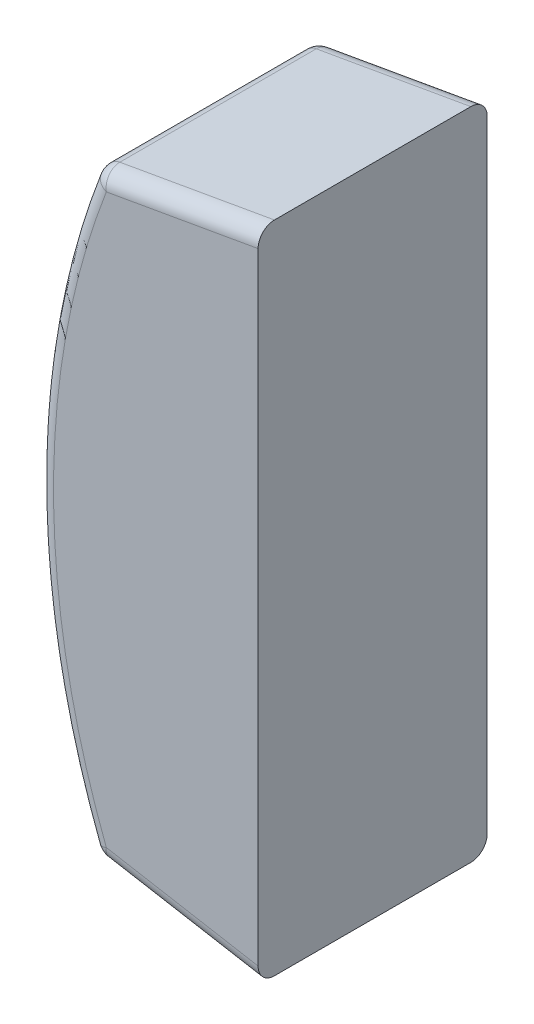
ISO-10303-21;
HEADER;
FILE_DESCRIPTION(('STEP AP214'),'2;1');
FILE_NAME('part.step','',(''),(''),'','','');
FILE_SCHEMA(('AUTOMOTIVE_DESIGN { 1 0 10303 214 1 1 1 1 }'));
ENDSEC;
DATA;
#1=APPLICATION_CONTEXT('core data for automotive mechanical design processes');
#2=APPLICATION_PROTOCOL_DEFINITION('international standard','automotive_design',2000,#1);
#3=PRODUCT_CONTEXT('',#1,'mechanical');
#4=PRODUCT('Part','Part','',(#3));
#5=PRODUCT_RELATED_PRODUCT_CATEGORY('part','',(#4));
#6=PRODUCT_DEFINITION_FORMATION('','',#4);
#7=PRODUCT_DEFINITION_CONTEXT('part definition',#1,'design');
#8=PRODUCT_DEFINITION('design','',#6,#7);
#9=PRODUCT_DEFINITION_SHAPE('','',#8);
#10=(LENGTH_UNIT() NAMED_UNIT(*) SI_UNIT(.MILLI.,.METRE.));
#11=(NAMED_UNIT(*) PLANE_ANGLE_UNIT() SI_UNIT($,.RADIAN.));
#12=(NAMED_UNIT(*) SI_UNIT($,.STERADIAN.) SOLID_ANGLE_UNIT());
#13=UNCERTAINTY_MEASURE_WITH_UNIT(LENGTH_MEASURE(1.E-05),#10,'distance_accuracy_value','');
#14=(GEOMETRIC_REPRESENTATION_CONTEXT(3) GLOBAL_UNCERTAINTY_ASSIGNED_CONTEXT((#13)) GLOBAL_UNIT_ASSIGNED_CONTEXT((#10,
#11,#12)) REPRESENTATION_CONTEXT('',''));
#15=CARTESIAN_POINT('',(0.,0.,0.));
#16=DIRECTION('',(0.,0.,1.));
#17=DIRECTION('',(1.,0.,0.));
#18=AXIS2_PLACEMENT_3D('',#15,#16,#17);
#19=CARTESIAN_POINT('',(0.,0.,28.));
#20=DIRECTION('',(0.173648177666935,0.984807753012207,0.));
#21=DIRECTION('',(-0.984807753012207,0.173648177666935,0.));
#22=AXIS2_PLACEMENT_3D('',#19,#20,#21);
#23=PLANE('',#22);
#24=DIRECTION('',(0.,0.,-1.));
#25=VECTOR('',#24,1.);
#26=CARTESIAN_POINT('',(-18.894708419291,3.3316468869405,28.));
#27=LINE('',#26,#25);
#28=CARTESIAN_POINT('',(-18.894708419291,3.3316468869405,26.));
#29=VERTEX_POINT('',#28);
#30=CARTESIAN_POINT('',(-18.894708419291,3.3316468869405,2.));
#31=VERTEX_POINT('',#30);
#32=EDGE_CURVE('E134',#29,#31,#27,.T.);
#33=ORIENTED_EDGE('',*,*,#32,.T.);
#34=DIRECTION('',(0.984807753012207,-0.173648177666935,0.));
#35=VECTOR('',#34,1.);
#36=CARTESIAN_POINT('',(0.,0.,2.));
#37=LINE('',#36,#35);
#38=CARTESIAN_POINT('',(0.,0.,2.));
#39=VERTEX_POINT('',#38);
#40=EDGE_CURVE('E133',#31,#39,#37,.T.);
#41=ORIENTED_EDGE('',*,*,#40,.T.);
#42=DIRECTION('',(0.,0.,-1.));
#43=VECTOR('',#42,1.);
#44=CARTESIAN_POINT('',(0.,0.,28.));
#45=LINE('',#44,#43);
#46=CARTESIAN_POINT('',(0.,0.,26.));
#47=VERTEX_POINT('',#46);
#48=EDGE_CURVE('E119',#47,#39,#45,.T.);
#49=ORIENTED_EDGE('',*,*,#48,.F.);
#50=DIRECTION('',(0.984807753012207,-0.173648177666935,0.));
#51=VECTOR('',#50,1.);
#52=CARTESIAN_POINT('',(-20.,3.52653961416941,26.));
#53=LINE('',#52,#51);
#54=EDGE_CURVE('E130',#47,#29,#53,.F.);
#55=ORIENTED_EDGE('',*,*,#54,.T.);
#56=EDGE_LOOP('',(#33,#41,#49,#55));
#57=FACE_BOUND('',#56,.T.);
#58=ADVANCED_FACE('F39',(#57),#23,.F.);
#59=CARTESIAN_POINT('',(0.,0.,28.));
#60=DIRECTION('',(-1.,0.,0.));
#61=DIRECTION('',(0.,0.,1.));
#62=AXIS2_PLACEMENT_3D('',#59,#60,#61);
#63=PLANE('',#62);
#64=ORIENTED_EDGE('',*,*,#48,.T.);
#65=CARTESIAN_POINT('',(0.,2.03085322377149,2.));
#66=DIRECTION('',(-1.,0.,0.));
#67=DIRECTION('',(0.,-1.,0.));
#68=AXIS2_PLACEMENT_3D('',#65,#66,#67);
#69=ELLIPSE('',#68,2.03085322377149,2.);
#70=CARTESIAN_POINT('',(0.,2.03085322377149,0.));
#71=VERTEX_POINT('',#70);
#72=EDGE_CURVE('E125',#39,#71,#69,.F.);
#73=ORIENTED_EDGE('',*,*,#72,.T.);
#74=DIRECTION('',(0.,1.,0.));
#75=VECTOR('',#74,1.);
#76=CARTESIAN_POINT('',(0.,0.,0.));
#77=LINE('',#76,#75);
#78=CARTESIAN_POINT('',(0.,77.9691467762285,0.));
#79=VERTEX_POINT('',#78);
#80=EDGE_CURVE('E204',#71,#79,#77,.T.);
#81=ORIENTED_EDGE('',*,*,#80,.T.);
#82=CARTESIAN_POINT('',(0.,77.9691467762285,2.));
#83=DIRECTION('',(-1.,0.,0.));
#84=DIRECTION('',(0.,-1.,0.));
#85=AXIS2_PLACEMENT_3D('',#82,#83,#84);
#86=ELLIPSE('',#85,2.03085322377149,2.);
#87=CARTESIAN_POINT('',(0.,80.,2.));
#88=VERTEX_POINT('',#87);
#89=EDGE_CURVE('E126',#79,#88,#86,.F.);
#90=ORIENTED_EDGE('',*,*,#89,.T.);
#91=DIRECTION('',(0.,0.,-1.));
#92=VECTOR('',#91,1.);
#93=CARTESIAN_POINT('',(0.,80.,28.));
#94=LINE('',#93,#92);
#95=CARTESIAN_POINT('',(0.,80.,26.));
#96=VERTEX_POINT('',#95);
#97=EDGE_CURVE('E135',#96,#88,#94,.T.);
#98=ORIENTED_EDGE('',*,*,#97,.F.);
#99=CARTESIAN_POINT('',(0.,77.9691467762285,26.));
#100=DIRECTION('',(-1.,0.,0.));
#101=DIRECTION('',(0.,1.,0.));
#102=AXIS2_PLACEMENT_3D('',#99,#100,#101);
#103=ELLIPSE('',#102,2.03085322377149,2.);
#104=CARTESIAN_POINT('',(0.,77.9691467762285,28.));
#105=VERTEX_POINT('',#104);
#106=EDGE_CURVE('E142',#96,#105,#103,.F.);
#107=ORIENTED_EDGE('',*,*,#106,.T.);
#108=DIRECTION('',(0.,1.,0.));
#109=VECTOR('',#108,1.);
#110=CARTESIAN_POINT('',(0.,0.,28.));
#111=LINE('',#110,#109);
#112=CARTESIAN_POINT('',(0.,2.03085322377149,28.));
#113=VERTEX_POINT('',#112);
#114=EDGE_CURVE('E121',#113,#105,#111,.T.);
#115=ORIENTED_EDGE('',*,*,#114,.F.);
#116=CARTESIAN_POINT('',(0.,2.03085322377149,26.));
#117=DIRECTION('',(-1.,0.,0.));
#118=DIRECTION('',(0.,1.,0.));
#119=AXIS2_PLACEMENT_3D('',#116,#117,#118);
#120=ELLIPSE('',#119,2.03085322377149,2.);
#121=EDGE_CURVE('E116',#113,#47,#120,.F.);
#122=ORIENTED_EDGE('',*,*,#121,.T.);
#123=EDGE_LOOP('',(#64,#73,#81,#90,#98,#107,#115,#122));
#124=FACE_BOUND('',#123,.T.);
#125=ADVANCED_FACE('F118',(#124),#63,.F.);
#126=CARTESIAN_POINT('',(0.,80.,28.));
#127=DIRECTION('',(0.173648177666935,-0.984807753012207,0.));
#128=DIRECTION('',(0.984807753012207,0.173648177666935,0.));
#129=AXIS2_PLACEMENT_3D('',#126,#127,#128);
#130=PLANE('',#129);
#131=ORIENTED_EDGE('',*,*,#97,.T.);
#132=DIRECTION('',(-0.984807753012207,-0.173648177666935,0.));
#133=VECTOR('',#132,1.);
#134=CARTESIAN_POINT('',(0.,80.,2.));
#135=LINE('',#134,#133);
#136=CARTESIAN_POINT('',(-18.8947084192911,76.6683531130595,2.));
#137=VERTEX_POINT('',#136);
#138=EDGE_CURVE('E11',#88,#137,#135,.T.);
#139=ORIENTED_EDGE('',*,*,#138,.T.);
#140=DIRECTION('',(0.,0.,-1.));
#141=VECTOR('',#140,1.);
#142=CARTESIAN_POINT('',(-18.8947084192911,76.6683531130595,28.));
#143=LINE('',#142,#141);
#144=CARTESIAN_POINT('',(-18.8947084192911,76.6683531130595,26.));
#145=VERTEX_POINT('',#144);
#146=EDGE_CURVE('E55',#137,#145,#143,.F.);
#147=ORIENTED_EDGE('',*,*,#146,.T.);
#148=DIRECTION('',(-0.984807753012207,-0.173648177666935,0.));
#149=VECTOR('',#148,1.);
#150=CARTESIAN_POINT('',(0.,80.,26.));
#151=LINE('',#150,#149);
#152=EDGE_CURVE('E48',#145,#96,#151,.F.);
#153=ORIENTED_EDGE('',*,*,#152,.T.);
#154=EDGE_LOOP('',(#131,#139,#147,#153));
#155=FACE_BOUND('',#154,.T.);
#156=ADVANCED_FACE('F215',(#155),#130,.F.);
#157=CARTESIAN_POINT('',(71.5223794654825,40.,28.));
#158=DIRECTION('',(0.,0.,-1.));
#159=DIRECTION('',(-1.,0.,0.));
#160=AXIS2_PLACEMENT_3D('',#157,#158,#159);
#161=CYLINDRICAL_SURFACE('',#160,98.5223794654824);
#162=CARTESIAN_POINT('',(71.5223794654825,40.,2.));
#163=DIRECTION('',(0.,0.,1.));
#164=DIRECTION('',(1.,0.,0.));
#165=AXIS2_PLACEMENT_3D('',#162,#163,#164);
#166=CIRCLE('',#165,98.5223794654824);
#167=CARTESIAN_POINT('',(-20.4137106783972,75.4177156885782,2.));
#168=VERTEX_POINT('',#167);
#169=CARTESIAN_POINT('',(-20.4137106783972,4.58228431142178,2.));
#170=VERTEX_POINT('',#169);
#171=EDGE_CURVE('E165',#168,#170,#166,.T.);
#172=ORIENTED_EDGE('',*,*,#171,.T.);
#173=DIRECTION('',(0.,0.,-1.));
#174=VECTOR('',#173,1.);
#175=CARTESIAN_POINT('',(-20.4137106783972,4.58228431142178,28.));
#176=LINE('',#175,#174);
#177=CARTESIAN_POINT('',(-20.4137106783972,4.58228431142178,26.));
#178=VERTEX_POINT('',#177);
#179=EDGE_CURVE('E167',#170,#178,#176,.F.);
#180=ORIENTED_EDGE('',*,*,#179,.T.);
#181=CARTESIAN_POINT('',(71.5223794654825,40.,26.));
#182=DIRECTION('',(0.,0.,1.));
#183=DIRECTION('',(1.,0.,0.));
#184=AXIS2_PLACEMENT_3D('',#181,#182,#183);
#185=CIRCLE('',#184,98.5223794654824);
#186=CARTESIAN_POINT('',(-20.4137106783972,75.4177156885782,26.));
#187=VERTEX_POINT('',#186);
#188=EDGE_CURVE('E163',#178,#187,#185,.F.);
#189=ORIENTED_EDGE('',*,*,#188,.T.);
#190=DIRECTION('',(0.,0.,-1.));
#191=VECTOR('',#190,1.);
#192=CARTESIAN_POINT('',(-20.4137106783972,75.4177156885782,28.));
#193=LINE('',#192,#191);
#194=EDGE_CURVE('E161',#187,#168,#193,.T.);
#195=ORIENTED_EDGE('',*,*,#194,.T.);
#196=EDGE_LOOP('',(#172,#180,#189,#195));
#197=FACE_BOUND('',#196,.T.);
#198=ADVANCED_FACE('F228',(#197),#161,.T.);
#199=CARTESIAN_POINT('',(71.5223794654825,40.,28.));
#200=DIRECTION('',(0.,0.,1.));
#201=DIRECTION('',(1.,0.,0.));
#202=AXIS2_PLACEMENT_3D('',#199,#200,#201);
#203=PLANE('',#202);
#204=CARTESIAN_POINT('',(71.5223794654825,40.,28.));
#205=DIRECTION('',(0.,0.,1.));
#206=DIRECTION('',(1.,0.,0.));
#207=AXIS2_PLACEMENT_3D('',#204,#205,#206);
#208=CIRCLE('',#207,96.5223794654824);
#209=CARTESIAN_POINT('',(-18.5474120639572,74.6987376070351,28.));
#210=VERTEX_POINT('',#209);
#211=CARTESIAN_POINT('',(-18.5474120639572,5.30126239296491,28.));
#212=VERTEX_POINT('',#211);
#213=EDGE_CURVE('E157',#210,#212,#208,.T.);
#214=ORIENTED_EDGE('',*,*,#213,.T.);
#215=DIRECTION('',(0.984807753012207,-0.173648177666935,0.));
#216=VECTOR('',#215,1.);
#217=CARTESIAN_POINT('',(0.347296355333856,1.96961550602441,28.));
#218=LINE('',#217,#216);
#219=EDGE_CURVE('E159',#212,#113,#218,.T.);
#220=ORIENTED_EDGE('',*,*,#219,.T.);
#221=ORIENTED_EDGE('',*,*,#114,.T.);
#222=DIRECTION('',(-0.984807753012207,-0.173648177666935,0.));
#223=VECTOR('',#222,1.);
#224=CARTESIAN_POINT('',(-19.6527036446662,74.5038448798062,28.));
#225=LINE('',#224,#223);
#226=EDGE_CURVE('E155',#105,#210,#225,.T.);
#227=ORIENTED_EDGE('',*,*,#226,.T.);
#228=EDGE_LOOP('',(#214,#220,#221,#227));
#229=FACE_BOUND('',#228,.T.);
#230=ADVANCED_FACE('F353',(#229),#203,.T.);
#231=CARTESIAN_POINT('',(71.5223794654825,40.,0.));
#232=DIRECTION('',(0.,0.,1.));
#233=DIRECTION('',(1.,0.,0.));
#234=AXIS2_PLACEMENT_3D('',#231,#232,#233);
#235=PLANE('',#234);
#236=ORIENTED_EDGE('',*,*,#80,.F.);
#237=DIRECTION('',(0.984807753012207,-0.173648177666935,0.));
#238=VECTOR('',#237,1.);
#239=CARTESIAN_POINT('',(62.8726093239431,-9.0552841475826,0.));
#240=LINE('',#239,#238);
#241=CARTESIAN_POINT('',(-18.5474120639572,5.30126239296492,0.));
#242=VERTEX_POINT('',#241);
#243=EDGE_CURVE('E153',#71,#242,#240,.F.);
#244=ORIENTED_EDGE('',*,*,#243,.T.);
#245=CARTESIAN_POINT('',(71.5223794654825,40.,0.));
#246=DIRECTION('',(0.,0.,1.));
#247=DIRECTION('',(1.,0.,0.));
#248=AXIS2_PLACEMENT_3D('',#245,#246,#247);
#249=CIRCLE('',#248,96.5223794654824);
#250=CARTESIAN_POINT('',(-18.5474120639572,74.6987376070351,0.));
#251=VERTEX_POINT('',#250);
#252=EDGE_CURVE('E151',#242,#251,#249,.F.);
#253=ORIENTED_EDGE('',*,*,#252,.T.);
#254=DIRECTION('',(-0.984807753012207,-0.173648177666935,0.));
#255=VECTOR('',#254,1.);
#256=CARTESIAN_POINT('',(62.8726093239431,89.0552841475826,0.));
#257=LINE('',#256,#255);
#258=EDGE_CURVE('E149',#251,#79,#257,.F.);
#259=ORIENTED_EDGE('',*,*,#258,.T.);
#260=EDGE_LOOP('',(#236,#244,#253,#259));
#261=FACE_BOUND('',#260,.T.);
#262=ADVANCED_FACE('F242',(#261),#235,.F.);
#263=CARTESIAN_POINT('',(62.8726093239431,89.0552841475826,26.));
#264=DIRECTION('',(0.984807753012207,0.173648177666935,0.));
#265=DIRECTION('',(-0.173648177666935,0.984807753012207,0.));
#266=AXIS2_PLACEMENT_3D('',#263,#264,#265);
#267=CYLINDRICAL_SURFACE('',#266,2.);
#268=CARTESIAN_POINT('',(-18.5474120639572,74.6987376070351,26.));
#269=DIRECTION('',(-0.984807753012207,-0.173648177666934,0.));
#270=DIRECTION('',(0.173648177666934,-0.984807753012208,0.));
#271=AXIS2_PLACEMENT_3D('',#268,#269,#270);
#272=CIRCLE('',#271,2.);
#273=EDGE_CURVE('E43',#210,#145,#272,.T.);
#274=ORIENTED_EDGE('',*,*,#273,.F.);
#275=ORIENTED_EDGE('',*,*,#226,.F.);
#276=ORIENTED_EDGE('',*,*,#106,.F.);
#277=ORIENTED_EDGE('',*,*,#152,.F.);
#278=EDGE_LOOP('',(#274,#275,#276,#277));
#279=FACE_BOUND('',#278,.T.);
#280=ADVANCED_FACE('F41',(#279),#267,.T.);
#281=CARTESIAN_POINT('',(-18.5474120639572,74.6987376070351,26.));
#282=DIRECTION('',(0.,0.,1.));
#283=DIRECTION('',(1.,0.,0.));
#284=AXIS2_PLACEMENT_3D('',#281,#282,#283);
#285=SPHERICAL_SURFACE('',#284,2.);
#286=CARTESIAN_POINT('',(-18.5474120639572,74.6987376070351,26.));
#287=DIRECTION('',(0.359489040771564,0.933149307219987,0.));
#288=DIRECTION('',(-0.933149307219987,0.359489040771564,0.));
#289=AXIS2_PLACEMENT_3D('',#286,#287,#288);
#290=CIRCLE('',#289,2.);
#291=EDGE_CURVE('E196',#210,#187,#290,.F.);
#292=ORIENTED_EDGE('',*,*,#291,.F.);
#293=ORIENTED_EDGE('',*,*,#273,.T.);
#294=CARTESIAN_POINT('',(-18.5474120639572,74.6987376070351,26.));
#295=DIRECTION('',(0.,0.,1.));
#296=DIRECTION('',(1.,0.,0.));
#297=AXIS2_PLACEMENT_3D('',#294,#295,#296);
#298=CIRCLE('',#297,2.);
#299=EDGE_CURVE('E198',#187,#145,#298,.F.);
#300=ORIENTED_EDGE('',*,*,#299,.F.);
#301=EDGE_LOOP('',(#292,#293,#300));
#302=FACE_BOUND('',#301,.T.);
#303=ADVANCED_FACE('F235',(#302),#285,.T.);
#304=CARTESIAN_POINT('',(0.347296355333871,78.0303844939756,2.));
#305=DIRECTION('',(-0.984807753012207,-0.173648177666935,0.));
#306=DIRECTION('',(0.173648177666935,-0.984807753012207,0.));
#307=AXIS2_PLACEMENT_3D('',#304,#305,#306);
#308=CYLINDRICAL_SURFACE('',#307,2.);
#309=ORIENTED_EDGE('',*,*,#89,.F.);
#310=ORIENTED_EDGE('',*,*,#258,.F.);
#311=CARTESIAN_POINT('',(-18.5474120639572,74.6987376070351,2.));
#312=DIRECTION('',(-0.984807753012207,-0.173648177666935,0.));
#313=DIRECTION('',(0.173648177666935,-0.984807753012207,0.));
#314=AXIS2_PLACEMENT_3D('',#311,#312,#313);
#315=CIRCLE('',#314,2.);
#316=EDGE_CURVE('E193',#137,#251,#315,.T.);
#317=ORIENTED_EDGE('',*,*,#316,.F.);
#318=ORIENTED_EDGE('',*,*,#138,.F.);
#319=EDGE_LOOP('',(#309,#310,#317,#318));
#320=FACE_BOUND('',#319,.T.);
#321=ADVANCED_FACE('F219',(#320),#308,.T.);
#322=CARTESIAN_POINT('',(-18.5474120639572,74.6987376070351,28.));
#323=DIRECTION('',(0.,0.,-1.));
#324=DIRECTION('',(-1.,0.,0.));
#325=AXIS2_PLACEMENT_3D('',#322,#323,#324);
#326=CYLINDRICAL_SURFACE('',#325,2.);
#327=ORIENTED_EDGE('',*,*,#299,.T.);
#328=ORIENTED_EDGE('',*,*,#146,.F.);
#329=CARTESIAN_POINT('',(-18.5474120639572,74.6987376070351,2.));
#330=DIRECTION('',(0.,0.,-1.));
#331=DIRECTION('',(-1.,0.,0.));
#332=AXIS2_PLACEMENT_3D('',#329,#330,#331);
#333=CIRCLE('',#332,2.);
#334=EDGE_CURVE('E190',#168,#137,#333,.T.);
#335=ORIENTED_EDGE('',*,*,#334,.F.);
#336=ORIENTED_EDGE('',*,*,#194,.F.);
#337=EDGE_LOOP('',(#327,#328,#335,#336));
#338=FACE_BOUND('',#337,.T.);
#339=ADVANCED_FACE('F226',(#338),#326,.T.);
#340=CARTESIAN_POINT('',(71.5223794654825,40.,26.));
#341=DIRECTION('',(0.,0.,1.));
#342=DIRECTION('',(1.,0.,0.));
#343=AXIS2_PLACEMENT_3D('',#340,#341,#342);
#344=TOROIDAL_SURFACE('',#343,96.5223794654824,2.);
#345=ORIENTED_EDGE('',*,*,#291,.T.);
#346=ORIENTED_EDGE('',*,*,#188,.F.);
#347=CARTESIAN_POINT('',(-18.5474120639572,5.30126239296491,26.));
#348=DIRECTION('',(0.359489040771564,-0.933149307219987,0.));
#349=DIRECTION('',(0.933149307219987,0.359489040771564,0.));
#350=AXIS2_PLACEMENT_3D('',#347,#348,#349);
#351=CIRCLE('',#350,2.);
#352=EDGE_CURVE('E187',#212,#178,#351,.T.);
#353=ORIENTED_EDGE('',*,*,#352,.F.);
#354=ORIENTED_EDGE('',*,*,#213,.F.);
#355=EDGE_LOOP('',(#345,#346,#353,#354));
#356=FACE_BOUND('',#355,.T.);
#357=ADVANCED_FACE('F234',(#356),#344,.T.);
#358=CARTESIAN_POINT('',(62.8726093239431,-9.0552841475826,26.));
#359=DIRECTION('',(-0.984807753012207,0.173648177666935,0.));
#360=DIRECTION('',(-0.173648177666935,-0.984807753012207,0.));
#361=AXIS2_PLACEMENT_3D('',#358,#359,#360);
#362=CYLINDRICAL_SURFACE('',#361,2.);
#363=ORIENTED_EDGE('',*,*,#121,.F.);
#364=ORIENTED_EDGE('',*,*,#219,.F.);
#365=CARTESIAN_POINT('',(-18.5474120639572,5.30126239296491,26.));
#366=DIRECTION('',(-0.984807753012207,0.173648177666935,0.));
#367=DIRECTION('',(-0.173648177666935,-0.984807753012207,0.));
#368=AXIS2_PLACEMENT_3D('',#365,#366,#367);
#369=CIRCLE('',#368,2.);
#370=EDGE_CURVE('E139',#29,#212,#369,.T.);
#371=ORIENTED_EDGE('',*,*,#370,.F.);
#372=ORIENTED_EDGE('',*,*,#54,.F.);
#373=EDGE_LOOP('',(#363,#364,#371,#372));
#374=FACE_BOUND('',#373,.T.);
#375=ADVANCED_FACE('F137',(#374),#362,.T.);
#376=CARTESIAN_POINT('',(-18.5474120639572,74.6987376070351,2.));
#377=DIRECTION('',(0.,0.,-1.));
#378=DIRECTION('',(0.,1.,0.));
#379=AXIS2_PLACEMENT_3D('',#376,#377,#378);
#380=SPHERICAL_SURFACE('',#379,2.);
#381=ORIENTED_EDGE('',*,*,#334,.T.);
#382=ORIENTED_EDGE('',*,*,#316,.T.);
#383=CARTESIAN_POINT('',(-18.5474120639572,74.6987376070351,2.));
#384=DIRECTION('',(0.359489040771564,0.933149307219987,0.));
#385=DIRECTION('',(-0.933149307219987,0.359489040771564,0.));
#386=AXIS2_PLACEMENT_3D('',#383,#384,#385);
#387=CIRCLE('',#386,2.);
#388=EDGE_CURVE('E183',#168,#251,#387,.F.);
#389=ORIENTED_EDGE('',*,*,#388,.F.);
#390=EDGE_LOOP('',(#381,#382,#389));
#391=FACE_BOUND('',#390,.T.);
#392=ADVANCED_FACE('F224',(#391),#380,.T.);
#393=CARTESIAN_POINT('',(-18.5474120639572,5.30126239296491,26.));
#394=DIRECTION('',(0.,0.,1.));
#395=DIRECTION('',(1.,0.,0.));
#396=AXIS2_PLACEMENT_3D('',#393,#394,#395);
#397=SPHERICAL_SURFACE('',#396,2.);
#398=ORIENTED_EDGE('',*,*,#370,.T.);
#399=ORIENTED_EDGE('',*,*,#352,.T.);
#400=CARTESIAN_POINT('',(-18.5474120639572,5.30126239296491,26.));
#401=DIRECTION('',(0.,0.,1.));
#402=DIRECTION('',(1.,0.,0.));
#403=AXIS2_PLACEMENT_3D('',#400,#401,#402);
#404=CIRCLE('',#403,2.);
#405=EDGE_CURVE('E181',#29,#178,#404,.F.);
#406=ORIENTED_EDGE('',*,*,#405,.F.);
#407=EDGE_LOOP('',(#398,#399,#406));
#408=FACE_BOUND('',#407,.T.);
#409=ADVANCED_FACE('F267',(#408),#397,.T.);
#410=CARTESIAN_POINT('',(71.5223794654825,40.,2.));
#411=DIRECTION('',(0.,0.,1.));
#412=DIRECTION('',(1.,0.,0.));
#413=AXIS2_PLACEMENT_3D('',#410,#411,#412);
#414=TOROIDAL_SURFACE('',#413,96.5223794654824,2.);
#415=ORIENTED_EDGE('',*,*,#388,.T.);
#416=ORIENTED_EDGE('',*,*,#252,.F.);
#417=CARTESIAN_POINT('',(-18.5474120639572,5.30126239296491,2.));
#418=DIRECTION('',(0.359489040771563,-0.933149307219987,0.));
#419=DIRECTION('',(0.933149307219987,0.359489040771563,0.));
#420=AXIS2_PLACEMENT_3D('',#417,#418,#419);
#421=CIRCLE('',#420,2.);
#422=EDGE_CURVE('E178',#170,#242,#421,.T.);
#423=ORIENTED_EDGE('',*,*,#422,.F.);
#424=ORIENTED_EDGE('',*,*,#171,.F.);
#425=EDGE_LOOP('',(#415,#416,#423,#424));
#426=FACE_BOUND('',#425,.T.);
#427=ADVANCED_FACE('F263',(#426),#414,.T.);
#428=CARTESIAN_POINT('',(-18.5474120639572,5.30126239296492,28.));
#429=DIRECTION('',(0.,0.,-1.));
#430=DIRECTION('',(-1.,0.,0.));
#431=AXIS2_PLACEMENT_3D('',#428,#429,#430);
#432=CYLINDRICAL_SURFACE('',#431,2.);
#433=ORIENTED_EDGE('',*,*,#405,.T.);
#434=ORIENTED_EDGE('',*,*,#179,.F.);
#435=CARTESIAN_POINT('',(-18.5474120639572,5.30126239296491,2.));
#436=DIRECTION('',(0.,0.,-1.));
#437=DIRECTION('',(-1.,0.,0.));
#438=AXIS2_PLACEMENT_3D('',#435,#436,#437);
#439=CIRCLE('',#438,2.);
#440=EDGE_CURVE('E175',#31,#170,#439,.T.);
#441=ORIENTED_EDGE('',*,*,#440,.F.);
#442=ORIENTED_EDGE('',*,*,#32,.F.);
#443=EDGE_LOOP('',(#433,#434,#441,#442));
#444=FACE_BOUND('',#443,.T.);
#445=ADVANCED_FACE('F259',(#444),#432,.T.);
#446=CARTESIAN_POINT('',(-18.5474120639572,5.30126239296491,2.));
#447=DIRECTION('',(0.,0.,-1.));
#448=DIRECTION('',(-1.,0.,0.));
#449=AXIS2_PLACEMENT_3D('',#446,#447,#448);
#450=SPHERICAL_SURFACE('',#449,2.);
#451=ORIENTED_EDGE('',*,*,#440,.T.);
#452=ORIENTED_EDGE('',*,*,#422,.T.);
#453=CARTESIAN_POINT('',(-18.5474120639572,5.30126239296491,2.));
#454=DIRECTION('',(-0.984807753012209,0.173648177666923,0.));
#455=DIRECTION('',(-0.173648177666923,-0.984807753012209,0.));
#456=AXIS2_PLACEMENT_3D('',#453,#454,#455);
#457=CIRCLE('',#456,2.);
#458=EDGE_CURVE('E172',#31,#242,#457,.F.);
#459=ORIENTED_EDGE('',*,*,#458,.F.);
#460=EDGE_LOOP('',(#451,#452,#459));
#461=FACE_BOUND('',#460,.T.);
#462=ADVANCED_FACE('F255',(#461),#450,.T.);
#463=CARTESIAN_POINT('',(0.34729635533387,1.96961550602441,2.));
#464=DIRECTION('',(0.984807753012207,-0.173648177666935,0.));
#465=DIRECTION('',(0.173648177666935,0.984807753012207,0.));
#466=AXIS2_PLACEMENT_3D('',#463,#464,#465);
#467=CYLINDRICAL_SURFACE('',#466,2.);
#468=ORIENTED_EDGE('',*,*,#458,.T.);
#469=ORIENTED_EDGE('',*,*,#243,.F.);
#470=ORIENTED_EDGE('',*,*,#72,.F.);
#471=ORIENTED_EDGE('',*,*,#40,.F.);
#472=EDGE_LOOP('',(#468,#469,#470,#471));
#473=FACE_BOUND('',#472,.T.);
#474=ADVANCED_FACE('F252',(#473),#467,.T.);
#475=CLOSED_SHELL('',(#58,#125,#156,#198,#230,#262,#280,#303,#321,#339,#357,#375,#392,#409,#427,
#445,#462,#474));
#476=MANIFOLD_SOLID_BREP('B2',#475);
#477=ADVANCED_BREP_SHAPE_REPRESENTATION('',(#18,#476),#14);
#478=SHAPE_DEFINITION_REPRESENTATION(#9,#477);
ENDSEC;
END-ISO-10303-21;
